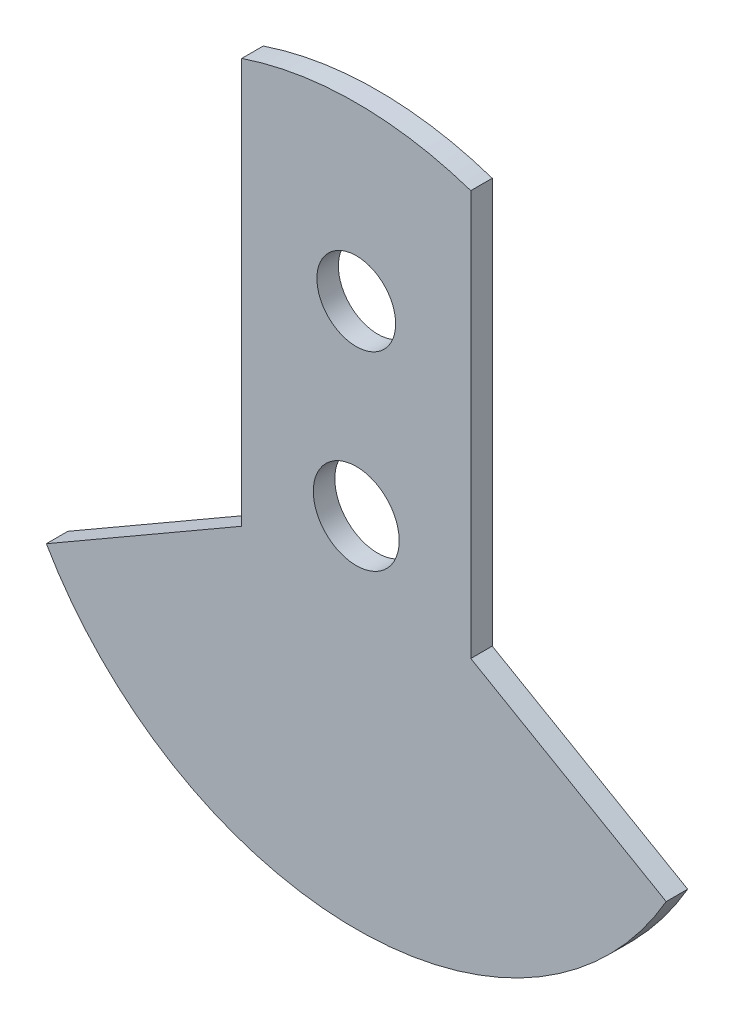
from build123d import *

# Parameters (mm, degrees)
SKETCH1_R      = 3
SKETCH1_R_2    = 2.75
EXTRUDE1_DEPTH = 1.5


with BuildPart() as part:
    # Sketch1 → Extrude1 (new body)
    with BuildSketch(Plane.XY):
        with BuildLine():
            Line((8, -4.618802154), (21.650635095, -12.5))
            ThreePointArc((21.650635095, -12.5), (0, -25), (-21.650635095, -12.5))
            Line((-21.650635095, -12.5), (-8, -4.618802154))
            Line((-8, -4.618802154), (-8, 23.685438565))
            ThreePointArc((-8, 23.685438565), (0, 25), (8, 23.685438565))
            Line((8, 23.685438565), (8, -4.618802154))
        make_face()
        Circle(SKETCH1_R, mode=Mode.SUBTRACT)
        with Locations((0, 13)):
            Circle(SKETCH1_R_2, mode=Mode.SUBTRACT)
    extrude(amount=EXTRUDE1_DEPTH)


solid = part.part
